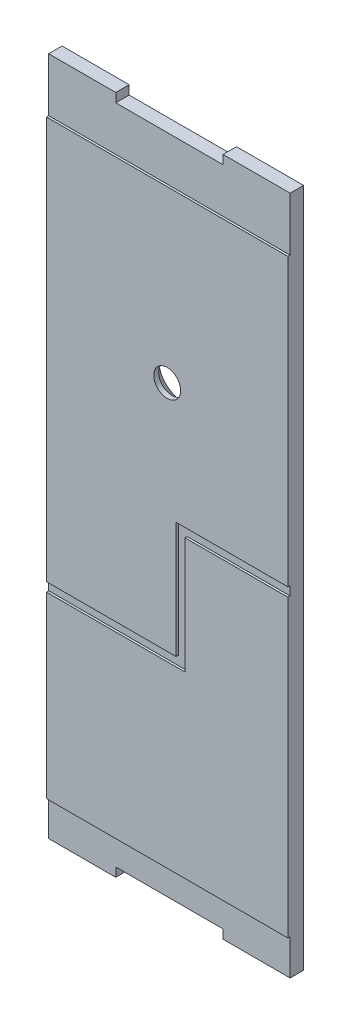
ISO-10303-21;
HEADER;
FILE_DESCRIPTION(('STEP AP214'),'2;1');
FILE_NAME('part.step','',(''),(''),'','','');
FILE_SCHEMA(('AUTOMOTIVE_DESIGN { 1 0 10303 214 1 1 1 1 }'));
ENDSEC;
DATA;
#1=APPLICATION_CONTEXT('core data for automotive mechanical design processes');
#2=APPLICATION_PROTOCOL_DEFINITION('international standard','automotive_design',2000,#1);
#3=PRODUCT_CONTEXT('',#1,'mechanical');
#4=PRODUCT('Part','Part','',(#3));
#5=PRODUCT_RELATED_PRODUCT_CATEGORY('part','',(#4));
#6=PRODUCT_DEFINITION_FORMATION('','',#4);
#7=PRODUCT_DEFINITION_CONTEXT('part definition',#1,'design');
#8=PRODUCT_DEFINITION('design','',#6,#7);
#9=PRODUCT_DEFINITION_SHAPE('','',#8);
#10=(LENGTH_UNIT() NAMED_UNIT(*) SI_UNIT(.MILLI.,.METRE.));
#11=(NAMED_UNIT(*) PLANE_ANGLE_UNIT() SI_UNIT($,.RADIAN.));
#12=(NAMED_UNIT(*) SI_UNIT($,.STERADIAN.) SOLID_ANGLE_UNIT());
#13=UNCERTAINTY_MEASURE_WITH_UNIT(LENGTH_MEASURE(1.E-05),#10,'distance_accuracy_value','');
#14=(GEOMETRIC_REPRESENTATION_CONTEXT(3) GLOBAL_UNCERTAINTY_ASSIGNED_CONTEXT((#13)) GLOBAL_UNIT_ASSIGNED_CONTEXT((#10,
#11,#12)) REPRESENTATION_CONTEXT('',''));
#15=CARTESIAN_POINT('',(0.,0.,0.));
#16=DIRECTION('',(0.,0.,1.));
#17=DIRECTION('',(1.,0.,0.));
#18=AXIS2_PLACEMENT_3D('',#15,#16,#17);
#19=CARTESIAN_POINT('',(0.,0.,1.5));
#20=DIRECTION('',(0.,1.,0.));
#21=DIRECTION('',(0.,0.,1.));
#22=AXIS2_PLACEMENT_3D('',#19,#20,#21);
#23=PLANE('',#22);
#24=DIRECTION('',(1.,0.,0.));
#25=VECTOR('',#24,1.);
#26=CARTESIAN_POINT('',(0.,0.,0.));
#27=LINE('',#26,#25);
#28=CARTESIAN_POINT('',(0.,0.,0.));
#29=VERTEX_POINT('',#28);
#30=CARTESIAN_POINT('',(7.50000000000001,0.,0.));
#31=VERTEX_POINT('',#30);
#32=EDGE_CURVE('E214',#29,#31,#27,.T.);
#33=ORIENTED_EDGE('',*,*,#32,.T.);
#34=DIRECTION('',(0.,0.,1.));
#35=VECTOR('',#34,1.);
#36=CARTESIAN_POINT('',(7.50000000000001,0.,0.));
#37=LINE('',#36,#35);
#38=CARTESIAN_POINT('',(7.50000000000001,0.,1.5));
#39=VERTEX_POINT('',#38);
#40=EDGE_CURVE('E197',#31,#39,#37,.T.);
#41=ORIENTED_EDGE('',*,*,#40,.T.);
#42=DIRECTION('',(1.,0.,0.));
#43=VECTOR('',#42,1.);
#44=CARTESIAN_POINT('',(0.,0.,1.5));
#45=LINE('',#44,#43);
#46=CARTESIAN_POINT('',(0.,0.,1.5));
#47=VERTEX_POINT('',#46);
#48=EDGE_CURVE('E285',#47,#39,#45,.T.);
#49=ORIENTED_EDGE('',*,*,#48,.F.);
#50=DIRECTION('',(0.,0.,-1.));
#51=VECTOR('',#50,1.);
#52=CARTESIAN_POINT('',(0.,0.,1.5));
#53=LINE('',#52,#51);
#54=EDGE_CURVE('E222',#47,#29,#53,.T.);
#55=ORIENTED_EDGE('',*,*,#54,.T.);
#56=EDGE_LOOP('',(#33,#41,#49,#55));
#57=FACE_BOUND('',#56,.T.);
#58=ADVANCED_FACE('F35',(#57),#23,.F.);
#59=CARTESIAN_POINT('',(0.,76.,1.5));
#60=DIRECTION('',(0.,-1.,0.));
#61=DIRECTION('',(0.,0.,-1.));
#62=AXIS2_PLACEMENT_3D('',#59,#60,#61);
#63=PLANE('',#62);
#64=DIRECTION('',(-1.,0.,0.));
#65=VECTOR('',#64,1.);
#66=CARTESIAN_POINT('',(0.,76.,1.5));
#67=LINE('',#66,#65);
#68=CARTESIAN_POINT('',(7.49999999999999,76.,1.5));
#69=VERTEX_POINT('',#68);
#70=CARTESIAN_POINT('',(0.,76.,1.5));
#71=VERTEX_POINT('',#70);
#72=EDGE_CURVE('E314',#69,#71,#67,.T.);
#73=ORIENTED_EDGE('',*,*,#72,.F.);
#74=DIRECTION('',(0.,0.,1.));
#75=VECTOR('',#74,1.);
#76=CARTESIAN_POINT('',(7.49999999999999,76.,0.));
#77=LINE('',#76,#75);
#78=CARTESIAN_POINT('',(7.49999999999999,76.,0.));
#79=VERTEX_POINT('',#78);
#80=EDGE_CURVE('E364',#79,#69,#77,.T.);
#81=ORIENTED_EDGE('',*,*,#80,.F.);
#82=DIRECTION('',(-1.,0.,0.));
#83=VECTOR('',#82,1.);
#84=CARTESIAN_POINT('',(0.,76.,0.));
#85=LINE('',#84,#83);
#86=CARTESIAN_POINT('',(0.,76.,0.));
#87=VERTEX_POINT('',#86);
#88=EDGE_CURVE('E227',#79,#87,#85,.T.);
#89=ORIENTED_EDGE('',*,*,#88,.T.);
#90=DIRECTION('',(0.,0.,-1.));
#91=VECTOR('',#90,1.);
#92=CARTESIAN_POINT('',(0.,76.,1.5));
#93=LINE('',#92,#91);
#94=EDGE_CURVE('E236',#71,#87,#93,.T.);
#95=ORIENTED_EDGE('',*,*,#94,.F.);
#96=EDGE_LOOP('',(#73,#81,#89,#95));
#97=FACE_BOUND('',#96,.T.);
#98=ADVANCED_FACE('F258',(#97),#63,.F.);
#99=CARTESIAN_POINT('',(0.,0.,1.75));
#100=DIRECTION('',(0.,0.,1.));
#101=DIRECTION('',(1.,0.,0.));
#102=AXIS2_PLACEMENT_3D('',#99,#100,#101);
#103=PLANE('',#102);
#104=DIRECTION('',(1.,0.,0.));
#105=VECTOR('',#104,1.);
#106=CARTESIAN_POINT('',(15.5,37.,1.75));
#107=LINE('',#106,#105);
#108=CARTESIAN_POINT('',(15.5,37.,1.75));
#109=VERTEX_POINT('',#108);
#110=CARTESIAN_POINT('',(27.,37.,1.75));
#111=VERTEX_POINT('',#110);
#112=EDGE_CURVE('E367',#109,#111,#107,.T.);
#113=ORIENTED_EDGE('',*,*,#112,.F.);
#114=DIRECTION('',(0.,1.,0.));
#115=VECTOR('',#114,1.);
#116=CARTESIAN_POINT('',(15.5,37.,1.75));
#117=LINE('',#116,#115);
#118=CARTESIAN_POINT('',(15.5,24.,1.75));
#119=VERTEX_POINT('',#118);
#120=EDGE_CURVE('E379',#119,#109,#117,.T.);
#121=ORIENTED_EDGE('',*,*,#120,.F.);
#122=DIRECTION('',(1.,0.,0.));
#123=VECTOR('',#122,1.);
#124=CARTESIAN_POINT('',(15.5,24.,1.75));
#125=LINE('',#124,#123);
#126=CARTESIAN_POINT('',(0.,24.,1.75));
#127=VERTEX_POINT('',#126);
#128=EDGE_CURVE('E407',#127,#119,#125,.T.);
#129=ORIENTED_EDGE('',*,*,#128,.F.);
#130=DIRECTION('',(0.,-1.,0.));
#131=VECTOR('',#130,1.);
#132=CARTESIAN_POINT('',(0.,76.,1.75));
#133=LINE('',#132,#131);
#134=CARTESIAN_POINT('',(0.,4.,1.75));
#135=VERTEX_POINT('',#134);
#136=EDGE_CURVE('E324',#127,#135,#133,.T.);
#137=ORIENTED_EDGE('',*,*,#136,.T.);
#138=DIRECTION('',(-1.,0.,0.));
#139=VECTOR('',#138,1.);
#140=CARTESIAN_POINT('',(0.,4.,1.75));
#141=LINE('',#140,#139);
#142=CARTESIAN_POINT('',(27.,4.,1.75));
#143=VERTEX_POINT('',#142);
#144=EDGE_CURVE('E289',#143,#135,#141,.T.);
#145=ORIENTED_EDGE('',*,*,#144,.F.);
#146=DIRECTION('',(0.,1.,0.));
#147=VECTOR('',#146,1.);
#148=CARTESIAN_POINT('',(27.,0.,1.75));
#149=LINE('',#148,#147);
#150=EDGE_CURVE('E329',#143,#111,#149,.T.);
#151=ORIENTED_EDGE('',*,*,#150,.T.);
#152=EDGE_LOOP('',(#113,#121,#129,#137,#145,#151));
#153=FACE_BOUND('',#152,.T.);
#154=ADVANCED_FACE('F264',(#153),#103,.T.);
#155=CARTESIAN_POINT('',(27.,76.,0.));
#156=VERTEX_POINT('',#155);
#157=CARTESIAN_POINT('',(19.5,76.,0.));
#158=VERTEX_POINT('',#157);
#159=EDGE_CURVE('E233',#156,#158,#85,.T.);
#160=ORIENTED_EDGE('',*,*,#159,.T.);
#161=DIRECTION('',(0.,0.,1.));
#162=VECTOR('',#161,1.);
#163=CARTESIAN_POINT('',(19.5,76.,0.));
#164=LINE('',#163,#162);
#165=CARTESIAN_POINT('',(19.5,76.,1.5));
#166=VERTEX_POINT('',#165);
#167=EDGE_CURVE('E359',#158,#166,#164,.T.);
#168=ORIENTED_EDGE('',*,*,#167,.T.);
#169=CARTESIAN_POINT('',(27.,76.,1.5));
#170=VERTEX_POINT('',#169);
#171=EDGE_CURVE('E315',#170,#166,#67,.T.);
#172=ORIENTED_EDGE('',*,*,#171,.F.);
#173=DIRECTION('',(0.,0.,-1.));
#174=VECTOR('',#173,1.);
#175=CARTESIAN_POINT('',(27.,76.,1.5));
#176=LINE('',#175,#174);
#177=EDGE_CURVE('E239',#170,#156,#176,.T.);
#178=ORIENTED_EDGE('',*,*,#177,.T.);
#179=EDGE_LOOP('',(#160,#168,#172,#178));
#180=FACE_BOUND('',#179,.T.);
#181=ADVANCED_FACE('F267',(#180),#63,.F.);
#182=CARTESIAN_POINT('',(0.,0.,1.5));
#183=DIRECTION('',(1.,0.,0.));
#184=DIRECTION('',(0.,0.,-1.));
#185=AXIS2_PLACEMENT_3D('',#182,#183,#184);
#186=PLANE('',#185);
#187=ORIENTED_EDGE('',*,*,#136,.F.);
#188=DIRECTION('',(0.,0.,1.));
#189=VECTOR('',#188,1.);
#190=CARTESIAN_POINT('',(0.,24.,1.5));
#191=LINE('',#190,#189);
#192=CARTESIAN_POINT('',(0.,24.,1.5));
#193=VERTEX_POINT('',#192);
#194=EDGE_CURVE('E416',#193,#127,#191,.T.);
#195=ORIENTED_EDGE('',*,*,#194,.F.);
#196=DIRECTION('',(0.,-1.,0.));
#197=VECTOR('',#196,1.);
#198=CARTESIAN_POINT('',(0.,25.,1.5));
#199=LINE('',#198,#197);
#200=CARTESIAN_POINT('',(0.,25.,1.5));
#201=VERTEX_POINT('',#200);
#202=EDGE_CURVE('E390',#201,#193,#199,.T.);
#203=ORIENTED_EDGE('',*,*,#202,.F.);
#204=DIRECTION('',(0.,0.,1.));
#205=VECTOR('',#204,1.);
#206=CARTESIAN_POINT('',(0.,25.,1.5));
#207=LINE('',#206,#205);
#208=CARTESIAN_POINT('',(0.,25.,1.75));
#209=VERTEX_POINT('',#208);
#210=EDGE_CURVE('E418',#201,#209,#207,.T.);
#211=ORIENTED_EDGE('',*,*,#210,.T.);
#212=CARTESIAN_POINT('',(0.,70.,1.75));
#213=VERTEX_POINT('',#212);
#214=EDGE_CURVE('E326',#213,#209,#133,.T.);
#215=ORIENTED_EDGE('',*,*,#214,.F.);
#216=DIRECTION('',(0.,0.,1.));
#217=VECTOR('',#216,1.);
#218=CARTESIAN_POINT('',(0.,70.,1.5));
#219=LINE('',#218,#217);
#220=CARTESIAN_POINT('',(0.,70.,1.5));
#221=VERTEX_POINT('',#220);
#222=EDGE_CURVE('E318',#221,#213,#219,.T.);
#223=ORIENTED_EDGE('',*,*,#222,.F.);
#224=DIRECTION('',(0.,-1.,0.));
#225=VECTOR('',#224,1.);
#226=CARTESIAN_POINT('',(0.,76.,1.5));
#227=LINE('',#226,#225);
#228=EDGE_CURVE('E306',#71,#221,#227,.T.);
#229=ORIENTED_EDGE('',*,*,#228,.F.);
#230=ORIENTED_EDGE('',*,*,#94,.T.);
#231=DIRECTION('',(0.,-1.,0.));
#232=VECTOR('',#231,1.);
#233=CARTESIAN_POINT('',(0.,0.,0.));
#234=LINE('',#233,#232);
#235=EDGE_CURVE('E229',#87,#29,#234,.T.);
#236=ORIENTED_EDGE('',*,*,#235,.T.);
#237=ORIENTED_EDGE('',*,*,#54,.F.);
#238=DIRECTION('',(0.,-1.,0.));
#239=VECTOR('',#238,1.);
#240=CARTESIAN_POINT('',(0.,0.,1.5));
#241=LINE('',#240,#239);
#242=CARTESIAN_POINT('',(0.,4.,1.5));
#243=VERTEX_POINT('',#242);
#244=EDGE_CURVE('E286',#243,#47,#241,.T.);
#245=ORIENTED_EDGE('',*,*,#244,.F.);
#246=DIRECTION('',(0.,0.,1.));
#247=VECTOR('',#246,1.);
#248=CARTESIAN_POINT('',(0.,4.,1.5));
#249=LINE('',#248,#247);
#250=EDGE_CURVE('E301',#243,#135,#249,.T.);
#251=ORIENTED_EDGE('',*,*,#250,.T.);
#252=EDGE_LOOP('',(#187,#195,#203,#211,#215,#223,#229,#230,#236,#237,#245,#251));
#253=FACE_BOUND('',#252,.T.);
#254=ADVANCED_FACE('F271',(#253),#186,.F.);
#255=CARTESIAN_POINT('',(19.5,0.,1.5));
#256=VERTEX_POINT('',#255);
#257=CARTESIAN_POINT('',(27.,0.,1.5));
#258=VERTEX_POINT('',#257);
#259=EDGE_CURVE('E281',#256,#258,#45,.T.);
#260=ORIENTED_EDGE('',*,*,#259,.F.);
#261=DIRECTION('',(0.,0.,1.));
#262=VECTOR('',#261,1.);
#263=CARTESIAN_POINT('',(19.5,0.,0.));
#264=LINE('',#263,#262);
#265=CARTESIAN_POINT('',(19.5,0.,0.));
#266=VERTEX_POINT('',#265);
#267=EDGE_CURVE('E50',#266,#256,#264,.T.);
#268=ORIENTED_EDGE('',*,*,#267,.F.);
#269=CARTESIAN_POINT('',(27.,0.,0.));
#270=VERTEX_POINT('',#269);
#271=EDGE_CURVE('E224',#266,#270,#27,.T.);
#272=ORIENTED_EDGE('',*,*,#271,.T.);
#273=DIRECTION('',(0.,0.,-1.));
#274=VECTOR('',#273,1.);
#275=CARTESIAN_POINT('',(27.,0.,1.5));
#276=LINE('',#275,#274);
#277=EDGE_CURVE('E241',#258,#270,#276,.T.);
#278=ORIENTED_EDGE('',*,*,#277,.F.);
#279=EDGE_LOOP('',(#260,#268,#272,#278));
#280=FACE_BOUND('',#279,.T.);
#281=ADVANCED_FACE('F260',(#280),#23,.F.);
#282=CARTESIAN_POINT('',(27.,0.,1.5));
#283=DIRECTION('',(-1.,0.,0.));
#284=DIRECTION('',(0.,0.,1.));
#285=AXIS2_PLACEMENT_3D('',#282,#283,#284);
#286=PLANE('',#285);
#287=DIRECTION('',(0.,1.,0.));
#288=VECTOR('',#287,1.);
#289=CARTESIAN_POINT('',(27.,38.,1.5));
#290=LINE('',#289,#288);
#291=CARTESIAN_POINT('',(27.,37.,1.5));
#292=VERTEX_POINT('',#291);
#293=CARTESIAN_POINT('',(27.,38.,1.5));
#294=VERTEX_POINT('',#293);
#295=EDGE_CURVE('E378',#292,#294,#290,.T.);
#296=ORIENTED_EDGE('',*,*,#295,.F.);
#297=DIRECTION('',(0.,0.,1.));
#298=VECTOR('',#297,1.);
#299=CARTESIAN_POINT('',(27.,37.,1.5));
#300=LINE('',#299,#298);
#301=EDGE_CURVE('E399',#292,#111,#300,.T.);
#302=ORIENTED_EDGE('',*,*,#301,.T.);
#303=ORIENTED_EDGE('',*,*,#150,.F.);
#304=DIRECTION('',(0.,0.,1.));
#305=VECTOR('',#304,1.);
#306=CARTESIAN_POINT('',(27.,4.,1.5));
#307=LINE('',#306,#305);
#308=CARTESIAN_POINT('',(27.,4.,1.5));
#309=VERTEX_POINT('',#308);
#310=EDGE_CURVE('E297',#309,#143,#307,.T.);
#311=ORIENTED_EDGE('',*,*,#310,.F.);
#312=DIRECTION('',(0.,1.,0.));
#313=VECTOR('',#312,1.);
#314=CARTESIAN_POINT('',(27.,0.,1.5));
#315=LINE('',#314,#313);
#316=EDGE_CURVE('E288',#258,#309,#315,.T.);
#317=ORIENTED_EDGE('',*,*,#316,.F.);
#318=ORIENTED_EDGE('',*,*,#277,.T.);
#319=DIRECTION('',(0.,1.,0.));
#320=VECTOR('',#319,1.);
#321=CARTESIAN_POINT('',(27.,0.,0.));
#322=LINE('',#321,#320);
#323=EDGE_CURVE('E223',#270,#156,#322,.T.);
#324=ORIENTED_EDGE('',*,*,#323,.T.);
#325=ORIENTED_EDGE('',*,*,#177,.F.);
#326=DIRECTION('',(0.,1.,0.));
#327=VECTOR('',#326,1.);
#328=CARTESIAN_POINT('',(27.,76.,1.5));
#329=LINE('',#328,#327);
#330=CARTESIAN_POINT('',(27.,70.,1.5));
#331=VERTEX_POINT('',#330);
#332=EDGE_CURVE('E312',#331,#170,#329,.T.);
#333=ORIENTED_EDGE('',*,*,#332,.F.);
#334=DIRECTION('',(0.,0.,1.));
#335=VECTOR('',#334,1.);
#336=CARTESIAN_POINT('',(27.,70.,1.5));
#337=LINE('',#336,#335);
#338=CARTESIAN_POINT('',(27.,70.,1.75));
#339=VERTEX_POINT('',#338);
#340=EDGE_CURVE('E321',#331,#339,#337,.T.);
#341=ORIENTED_EDGE('',*,*,#340,.T.);
#342=CARTESIAN_POINT('',(27.,38.,1.75));
#343=VERTEX_POINT('',#342);
#344=EDGE_CURVE('E328',#343,#339,#149,.T.);
#345=ORIENTED_EDGE('',*,*,#344,.F.);
#346=DIRECTION('',(0.,0.,1.));
#347=VECTOR('',#346,1.);
#348=CARTESIAN_POINT('',(27.,38.,1.5));
#349=LINE('',#348,#347);
#350=EDGE_CURVE('E425',#294,#343,#349,.T.);
#351=ORIENTED_EDGE('',*,*,#350,.F.);
#352=EDGE_LOOP('',(#296,#302,#303,#311,#317,#318,#324,#325,#333,#341,#345,#351));
#353=FACE_BOUND('',#352,.T.);
#354=ADVANCED_FACE('F270',(#353),#286,.F.);
#355=CARTESIAN_POINT('',(0.,0.,0.));
#356=DIRECTION('',(0.,0.,-1.));
#357=DIRECTION('',(-1.,0.,0.));
#358=AXIS2_PLACEMENT_3D('',#355,#356,#357);
#359=PLANE('',#358);
#360=CARTESIAN_POINT('',(13.5,51.,0.));
#361=DIRECTION('',(0.,0.,-1.));
#362=DIRECTION('',(-1.,0.,0.));
#363=AXIS2_PLACEMENT_3D('',#360,#361,#362);
#364=CIRCLE('',#363,2.69999999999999);
#365=CARTESIAN_POINT('',(10.8,51.,0.));
#366=VERTEX_POINT('',#365);
#367=EDGE_CURVE('E43',#366,#366,#364,.F.);
#368=ORIENTED_EDGE('',*,*,#367,.T.);
#369=EDGE_LOOP('',(#368));
#370=FACE_BOUND('',#369,.T.);
#371=DIRECTION('',(0.,-1.,0.));
#372=VECTOR('',#371,1.);
#373=CARTESIAN_POINT('',(7.50000000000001,0.,0.));
#374=LINE('',#373,#372);
#375=CARTESIAN_POINT('',(7.50000000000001,1.,0.));
#376=VERTEX_POINT('',#375);
#377=EDGE_CURVE('E200',#376,#31,#374,.T.);
#378=ORIENTED_EDGE('',*,*,#377,.T.);
#379=ORIENTED_EDGE('',*,*,#32,.F.);
#380=ORIENTED_EDGE('',*,*,#235,.F.);
#381=ORIENTED_EDGE('',*,*,#88,.F.);
#382=DIRECTION('',(0.,-1.,0.));
#383=VECTOR('',#382,1.);
#384=CARTESIAN_POINT('',(7.49999999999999,76.,0.));
#385=LINE('',#384,#383);
#386=CARTESIAN_POINT('',(7.49999999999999,75.,0.));
#387=VERTEX_POINT('',#386);
#388=EDGE_CURVE('E471',#79,#387,#385,.T.);
#389=ORIENTED_EDGE('',*,*,#388,.T.);
#390=DIRECTION('',(1.,0.,0.));
#391=VECTOR('',#390,1.);
#392=CARTESIAN_POINT('',(7.49999999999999,75.,0.));
#393=LINE('',#392,#391);
#394=CARTESIAN_POINT('',(19.5,75.,0.));
#395=VERTEX_POINT('',#394);
#396=EDGE_CURVE('E469',#387,#395,#393,.T.);
#397=ORIENTED_EDGE('',*,*,#396,.T.);
#398=DIRECTION('',(0.,1.,0.));
#399=VECTOR('',#398,1.);
#400=CARTESIAN_POINT('',(19.5,76.,0.));
#401=LINE('',#400,#399);
#402=EDGE_CURVE('E374',#395,#158,#401,.T.);
#403=ORIENTED_EDGE('',*,*,#402,.T.);
#404=ORIENTED_EDGE('',*,*,#159,.F.);
#405=ORIENTED_EDGE('',*,*,#323,.F.);
#406=ORIENTED_EDGE('',*,*,#271,.F.);
#407=DIRECTION('',(0.,1.,0.));
#408=VECTOR('',#407,1.);
#409=CARTESIAN_POINT('',(19.5,0.,0.));
#410=LINE('',#409,#408);
#411=CARTESIAN_POINT('',(19.5,1.,0.));
#412=VERTEX_POINT('',#411);
#413=EDGE_CURVE('E218',#266,#412,#410,.T.);
#414=ORIENTED_EDGE('',*,*,#413,.T.);
#415=DIRECTION('',(-1.,0.,0.));
#416=VECTOR('',#415,1.);
#417=CARTESIAN_POINT('',(7.50000000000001,1.,0.));
#418=LINE('',#417,#416);
#419=EDGE_CURVE('E208',#412,#376,#418,.T.);
#420=ORIENTED_EDGE('',*,*,#419,.T.);
#421=EDGE_LOOP('',(#378,#379,#380,#381,#389,#397,#403,#404,#405,#406,#414,#420));
#422=FACE_BOUND('',#421,.T.);
#423=ADVANCED_FACE('F212',(#370,#422),#359,.T.);
#424=DIRECTION('',(-1.,0.,0.));
#425=VECTOR('',#424,1.);
#426=CARTESIAN_POINT('',(0.,25.,1.75));
#427=LINE('',#426,#425);
#428=CARTESIAN_POINT('',(14.5,25.,1.75));
#429=VERTEX_POINT('',#428);
#430=EDGE_CURVE('E405',#429,#209,#427,.T.);
#431=ORIENTED_EDGE('',*,*,#430,.F.);
#432=DIRECTION('',(0.,-1.,0.));
#433=VECTOR('',#432,1.);
#434=CARTESIAN_POINT('',(14.5,38.,1.75));
#435=LINE('',#434,#433);
#436=CARTESIAN_POINT('',(14.5,38.,1.75));
#437=VERTEX_POINT('',#436);
#438=EDGE_CURVE('E402',#437,#429,#435,.T.);
#439=ORIENTED_EDGE('',*,*,#438,.F.);
#440=DIRECTION('',(-1.,0.,0.));
#441=VECTOR('',#440,1.);
#442=CARTESIAN_POINT('',(14.5,38.,1.75));
#443=LINE('',#442,#441);
#444=EDGE_CURVE('E345',#343,#437,#443,.T.);
#445=ORIENTED_EDGE('',*,*,#444,.F.);
#446=ORIENTED_EDGE('',*,*,#344,.T.);
#447=DIRECTION('',(1.,0.,0.));
#448=VECTOR('',#447,1.);
#449=CARTESIAN_POINT('',(0.,70.,1.75));
#450=LINE('',#449,#448);
#451=EDGE_CURVE('E304',#213,#339,#450,.T.);
#452=ORIENTED_EDGE('',*,*,#451,.F.);
#453=ORIENTED_EDGE('',*,*,#214,.T.);
#454=EDGE_LOOP('',(#431,#439,#445,#446,#452,#453));
#455=FACE_BOUND('',#454,.T.);
#456=CARTESIAN_POINT('',(13.5,51.,1.75));
#457=DIRECTION('',(0.,0.,1.));
#458=DIRECTION('',(1.,0.,0.));
#459=AXIS2_PLACEMENT_3D('',#456,#457,#458);
#460=CIRCLE('',#459,1.5);
#461=CARTESIAN_POINT('',(15.,51.,1.75));
#462=VERTEX_POINT('',#461);
#463=EDGE_CURVE('E300',#462,#462,#460,.T.);
#464=ORIENTED_EDGE('',*,*,#463,.F.);
#465=EDGE_LOOP('',(#464));
#466=FACE_BOUND('',#465,.T.);
#467=ADVANCED_FACE('F340',(#455,#466),#103,.T.);
#468=CARTESIAN_POINT('',(0.,70.,1.5));
#469=DIRECTION('',(0.,-1.,0.));
#470=DIRECTION('',(0.,0.,-1.));
#471=AXIS2_PLACEMENT_3D('',#468,#469,#470);
#472=PLANE('',#471);
#473=ORIENTED_EDGE('',*,*,#451,.T.);
#474=ORIENTED_EDGE('',*,*,#340,.F.);
#475=DIRECTION('',(1.,0.,0.));
#476=VECTOR('',#475,1.);
#477=CARTESIAN_POINT('',(0.,70.,1.5));
#478=LINE('',#477,#476);
#479=EDGE_CURVE('E309',#221,#331,#478,.T.);
#480=ORIENTED_EDGE('',*,*,#479,.F.);
#481=ORIENTED_EDGE('',*,*,#222,.T.);
#482=EDGE_LOOP('',(#473,#474,#480,#481));
#483=FACE_BOUND('',#482,.T.);
#484=ADVANCED_FACE('F348',(#483),#472,.F.);
#485=CARTESIAN_POINT('',(0.,0.,1.5));
#486=DIRECTION('',(0.,0.,1.));
#487=DIRECTION('',(1.,0.,0.));
#488=AXIS2_PLACEMENT_3D('',#485,#486,#487);
#489=PLANE('',#488);
#490=DIRECTION('',(0.,-1.,0.));
#491=VECTOR('',#490,1.);
#492=CARTESIAN_POINT('',(7.49999999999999,76.,1.5));
#493=LINE('',#492,#491);
#494=CARTESIAN_POINT('',(7.49999999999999,75.,1.5));
#495=VERTEX_POINT('',#494);
#496=EDGE_CURVE('E58',#69,#495,#493,.T.);
#497=ORIENTED_EDGE('',*,*,#496,.F.);
#498=ORIENTED_EDGE('',*,*,#72,.T.);
#499=ORIENTED_EDGE('',*,*,#228,.T.);
#500=ORIENTED_EDGE('',*,*,#479,.T.);
#501=ORIENTED_EDGE('',*,*,#332,.T.);
#502=ORIENTED_EDGE('',*,*,#171,.T.);
#503=DIRECTION('',(0.,1.,0.));
#504=VECTOR('',#503,1.);
#505=CARTESIAN_POINT('',(19.5,76.,1.5));
#506=LINE('',#505,#504);
#507=CARTESIAN_POINT('',(19.5,75.,1.5));
#508=VERTEX_POINT('',#507);
#509=EDGE_CURVE('E479',#508,#166,#506,.T.);
#510=ORIENTED_EDGE('',*,*,#509,.F.);
#511=DIRECTION('',(1.,0.,0.));
#512=VECTOR('',#511,1.);
#513=CARTESIAN_POINT('',(7.49999999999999,75.,1.5));
#514=LINE('',#513,#512);
#515=EDGE_CURVE('E476',#495,#508,#514,.T.);
#516=ORIENTED_EDGE('',*,*,#515,.F.);
#517=EDGE_LOOP('',(#497,#498,#499,#500,#501,#502,#510,#516));
#518=FACE_BOUND('',#517,.T.);
#519=ADVANCED_FACE('F355',(#518),#489,.T.);
#520=CARTESIAN_POINT('',(0.,4.,1.5));
#521=DIRECTION('',(0.,1.,0.));
#522=DIRECTION('',(0.,0.,1.));
#523=AXIS2_PLACEMENT_3D('',#520,#521,#522);
#524=PLANE('',#523);
#525=ORIENTED_EDGE('',*,*,#144,.T.);
#526=ORIENTED_EDGE('',*,*,#250,.F.);
#527=DIRECTION('',(-1.,0.,0.));
#528=VECTOR('',#527,1.);
#529=CARTESIAN_POINT('',(0.,4.,1.5));
#530=LINE('',#529,#528);
#531=EDGE_CURVE('E294',#309,#243,#530,.T.);
#532=ORIENTED_EDGE('',*,*,#531,.F.);
#533=ORIENTED_EDGE('',*,*,#310,.T.);
#534=EDGE_LOOP('',(#525,#526,#532,#533));
#535=FACE_BOUND('',#534,.T.);
#536=ADVANCED_FACE('F463',(#535),#524,.F.);
#537=CARTESIAN_POINT('',(0.,0.,1.5));
#538=DIRECTION('',(0.,0.,-1.));
#539=DIRECTION('',(-1.,0.,0.));
#540=AXIS2_PLACEMENT_3D('',#537,#538,#539);
#541=PLANE('',#540);
#542=ORIENTED_EDGE('',*,*,#48,.T.);
#543=DIRECTION('',(0.,-1.,0.));
#544=VECTOR('',#543,1.);
#545=CARTESIAN_POINT('',(7.50000000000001,0.,1.5));
#546=LINE('',#545,#544);
#547=CARTESIAN_POINT('',(7.50000000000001,1.,1.5));
#548=VERTEX_POINT('',#547);
#549=EDGE_CURVE('E203',#548,#39,#546,.T.);
#550=ORIENTED_EDGE('',*,*,#549,.F.);
#551=DIRECTION('',(-1.,0.,0.));
#552=VECTOR('',#551,1.);
#553=CARTESIAN_POINT('',(7.50000000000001,1.,1.5));
#554=LINE('',#553,#552);
#555=CARTESIAN_POINT('',(19.5,1.,1.5));
#556=VERTEX_POINT('',#555);
#557=EDGE_CURVE('E219',#556,#548,#554,.T.);
#558=ORIENTED_EDGE('',*,*,#557,.F.);
#559=DIRECTION('',(0.,1.,0.));
#560=VECTOR('',#559,1.);
#561=CARTESIAN_POINT('',(19.5,0.,1.5));
#562=LINE('',#561,#560);
#563=EDGE_CURVE('E488',#256,#556,#562,.T.);
#564=ORIENTED_EDGE('',*,*,#563,.F.);
#565=ORIENTED_EDGE('',*,*,#259,.T.);
#566=ORIENTED_EDGE('',*,*,#316,.T.);
#567=ORIENTED_EDGE('',*,*,#531,.T.);
#568=ORIENTED_EDGE('',*,*,#244,.T.);
#569=EDGE_LOOP('',(#542,#550,#558,#564,#565,#566,#567,#568));
#570=FACE_BOUND('',#569,.T.);
#571=ADVANCED_FACE('F464',(#570),#541,.F.);
#572=CARTESIAN_POINT('',(13.5,51.,0.));
#573=DIRECTION('',(0.,0.,1.));
#574=DIRECTION('',(1.,0.,0.));
#575=AXIS2_PLACEMENT_3D('',#572,#573,#574);
#576=CYLINDRICAL_SURFACE('',#575,1.5);
#577=CARTESIAN_POINT('',(13.5,51.,1.2));
#578=DIRECTION('',(0.,0.,-1.));
#579=DIRECTION('',(-1.,0.,0.));
#580=AXIS2_PLACEMENT_3D('',#577,#578,#579);
#581=CIRCLE('',#580,1.5);
#582=CARTESIAN_POINT('',(12.,51.,1.2));
#583=VERTEX_POINT('',#582);
#584=EDGE_CURVE('E11',#583,#583,#581,.T.);
#585=ORIENTED_EDGE('',*,*,#584,.T.);
#586=EDGE_LOOP('',(#585));
#587=FACE_BOUND('',#586,.T.);
#588=ORIENTED_EDGE('',*,*,#463,.T.);
#589=EDGE_LOOP('',(#588));
#590=FACE_BOUND('',#589,.T.);
#591=ADVANCED_FACE('F431',(#587,#590),#576,.F.);
#592=CARTESIAN_POINT('',(15.5,37.,1.5));
#593=DIRECTION('',(0.,-1.,0.));
#594=DIRECTION('',(0.,0.,-1.));
#595=AXIS2_PLACEMENT_3D('',#592,#593,#594);
#596=PLANE('',#595);
#597=ORIENTED_EDGE('',*,*,#112,.T.);
#598=ORIENTED_EDGE('',*,*,#301,.F.);
#599=DIRECTION('',(1.,0.,0.));
#600=VECTOR('',#599,1.);
#601=CARTESIAN_POINT('',(15.5,37.,1.5));
#602=LINE('',#601,#600);
#603=CARTESIAN_POINT('',(15.5,37.,1.5));
#604=VERTEX_POINT('',#603);
#605=EDGE_CURVE('E375',#604,#292,#602,.T.);
#606=ORIENTED_EDGE('',*,*,#605,.F.);
#607=DIRECTION('',(0.,0.,1.));
#608=VECTOR('',#607,1.);
#609=CARTESIAN_POINT('',(15.5,37.,1.5));
#610=LINE('',#609,#608);
#611=EDGE_CURVE('E412',#604,#109,#610,.T.);
#612=ORIENTED_EDGE('',*,*,#611,.T.);
#613=EDGE_LOOP('',(#597,#598,#606,#612));
#614=FACE_BOUND('',#613,.T.);
#615=ADVANCED_FACE('F447',(#614),#596,.F.);
#616=CARTESIAN_POINT('',(15.5,37.,1.5));
#617=DIRECTION('',(1.,0.,0.));
#618=DIRECTION('',(0.,1.,0.));
#619=AXIS2_PLACEMENT_3D('',#616,#617,#618);
#620=PLANE('',#619);
#621=ORIENTED_EDGE('',*,*,#120,.T.);
#622=ORIENTED_EDGE('',*,*,#611,.F.);
#623=DIRECTION('',(0.,1.,0.));
#624=VECTOR('',#623,1.);
#625=CARTESIAN_POINT('',(15.5,37.,1.5));
#626=LINE('',#625,#624);
#627=CARTESIAN_POINT('',(15.5,24.,1.5));
#628=VERTEX_POINT('',#627);
#629=EDGE_CURVE('E396',#628,#604,#626,.T.);
#630=ORIENTED_EDGE('',*,*,#629,.F.);
#631=DIRECTION('',(0.,0.,1.));
#632=VECTOR('',#631,1.);
#633=CARTESIAN_POINT('',(15.5,24.,1.5));
#634=LINE('',#633,#632);
#635=EDGE_CURVE('E414',#628,#119,#634,.T.);
#636=ORIENTED_EDGE('',*,*,#635,.T.);
#637=EDGE_LOOP('',(#621,#622,#630,#636));
#638=FACE_BOUND('',#637,.T.);
#639=ADVANCED_FACE('F454',(#638),#620,.F.);
#640=CARTESIAN_POINT('',(15.5,24.,1.5));
#641=DIRECTION('',(0.,-1.,0.));
#642=DIRECTION('',(1.,0.,0.));
#643=AXIS2_PLACEMENT_3D('',#640,#641,#642);
#644=PLANE('',#643);
#645=ORIENTED_EDGE('',*,*,#128,.T.);
#646=ORIENTED_EDGE('',*,*,#635,.F.);
#647=DIRECTION('',(1.,0.,0.));
#648=VECTOR('',#647,1.);
#649=CARTESIAN_POINT('',(15.5,24.,1.5));
#650=LINE('',#649,#648);
#651=EDGE_CURVE('E393',#193,#628,#650,.T.);
#652=ORIENTED_EDGE('',*,*,#651,.F.);
#653=ORIENTED_EDGE('',*,*,#194,.T.);
#654=EDGE_LOOP('',(#645,#646,#652,#653));
#655=FACE_BOUND('',#654,.T.);
#656=ADVANCED_FACE('F456',(#655),#644,.F.);
#657=CARTESIAN_POINT('',(0.,25.,1.5));
#658=DIRECTION('',(0.,1.,0.));
#659=DIRECTION('',(-1.,0.,0.));
#660=AXIS2_PLACEMENT_3D('',#657,#658,#659);
#661=PLANE('',#660);
#662=ORIENTED_EDGE('',*,*,#430,.T.);
#663=ORIENTED_EDGE('',*,*,#210,.F.);
#664=DIRECTION('',(-1.,0.,0.));
#665=VECTOR('',#664,1.);
#666=CARTESIAN_POINT('',(12.5,25.,1.5));
#667=LINE('',#666,#665);
#668=CARTESIAN_POINT('',(14.5,25.,1.5));
#669=VERTEX_POINT('',#668);
#670=EDGE_CURVE('E388',#669,#201,#667,.T.);
#671=ORIENTED_EDGE('',*,*,#670,.F.);
#672=DIRECTION('',(0.,0.,1.));
#673=VECTOR('',#672,1.);
#674=CARTESIAN_POINT('',(14.5,25.,1.5));
#675=LINE('',#674,#673);
#676=EDGE_CURVE('E421',#669,#429,#675,.T.);
#677=ORIENTED_EDGE('',*,*,#676,.T.);
#678=EDGE_LOOP('',(#662,#663,#671,#677));
#679=FACE_BOUND('',#678,.T.);
#680=ADVANCED_FACE('F520',(#679),#661,.F.);
#681=CARTESIAN_POINT('',(14.5,38.,1.5));
#682=DIRECTION('',(-1.,0.,0.));
#683=DIRECTION('',(0.,-1.,0.));
#684=AXIS2_PLACEMENT_3D('',#681,#682,#683);
#685=PLANE('',#684);
#686=ORIENTED_EDGE('',*,*,#438,.T.);
#687=ORIENTED_EDGE('',*,*,#676,.F.);
#688=DIRECTION('',(0.,-1.,0.));
#689=VECTOR('',#688,1.);
#690=CARTESIAN_POINT('',(14.5,38.,1.5));
#691=LINE('',#690,#689);
#692=CARTESIAN_POINT('',(14.5,38.,1.5));
#693=VERTEX_POINT('',#692);
#694=EDGE_CURVE('E385',#693,#669,#691,.T.);
#695=ORIENTED_EDGE('',*,*,#694,.F.);
#696=DIRECTION('',(0.,0.,1.));
#697=VECTOR('',#696,1.);
#698=CARTESIAN_POINT('',(14.5,38.,1.5));
#699=LINE('',#698,#697);
#700=EDGE_CURVE('E423',#693,#437,#699,.T.);
#701=ORIENTED_EDGE('',*,*,#700,.T.);
#702=EDGE_LOOP('',(#686,#687,#695,#701));
#703=FACE_BOUND('',#702,.T.);
#704=ADVANCED_FACE('F523',(#703),#685,.F.);
#705=CARTESIAN_POINT('',(14.5,38.,1.5));
#706=DIRECTION('',(0.,1.,0.));
#707=DIRECTION('',(0.,0.,1.));
#708=AXIS2_PLACEMENT_3D('',#705,#706,#707);
#709=PLANE('',#708);
#710=ORIENTED_EDGE('',*,*,#444,.T.);
#711=ORIENTED_EDGE('',*,*,#700,.F.);
#712=DIRECTION('',(-1.,0.,0.));
#713=VECTOR('',#712,1.);
#714=CARTESIAN_POINT('',(14.5,38.,1.5));
#715=LINE('',#714,#713);
#716=EDGE_CURVE('E382',#294,#693,#715,.T.);
#717=ORIENTED_EDGE('',*,*,#716,.F.);
#718=ORIENTED_EDGE('',*,*,#350,.T.);
#719=EDGE_LOOP('',(#710,#711,#717,#718));
#720=FACE_BOUND('',#719,.T.);
#721=ADVANCED_FACE('F515',(#720),#709,.F.);
#722=CARTESIAN_POINT('',(0.,0.,1.5));
#723=DIRECTION('',(0.,0.,-1.));
#724=DIRECTION('',(-1.,0.,0.));
#725=AXIS2_PLACEMENT_3D('',#722,#723,#724);
#726=PLANE('',#725);
#727=ORIENTED_EDGE('',*,*,#605,.T.);
#728=ORIENTED_EDGE('',*,*,#295,.T.);
#729=ORIENTED_EDGE('',*,*,#716,.T.);
#730=ORIENTED_EDGE('',*,*,#694,.T.);
#731=ORIENTED_EDGE('',*,*,#670,.T.);
#732=ORIENTED_EDGE('',*,*,#202,.T.);
#733=ORIENTED_EDGE('',*,*,#651,.T.);
#734=ORIENTED_EDGE('',*,*,#629,.T.);
#735=EDGE_LOOP('',(#727,#728,#729,#730,#731,#732,#733,#734));
#736=FACE_BOUND('',#735,.T.);
#737=ADVANCED_FACE('F451',(#736),#726,.F.);
#738=CARTESIAN_POINT('',(7.49999999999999,76.,0.));
#739=DIRECTION('',(-1.,0.,0.));
#740=DIRECTION('',(0.,-1.,0.));
#741=AXIS2_PLACEMENT_3D('',#738,#739,#740);
#742=PLANE('',#741);
#743=ORIENTED_EDGE('',*,*,#496,.T.);
#744=DIRECTION('',(0.,0.,1.));
#745=VECTOR('',#744,1.);
#746=CARTESIAN_POINT('',(7.49999999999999,75.,0.));
#747=LINE('',#746,#745);
#748=EDGE_CURVE('E369',#387,#495,#747,.T.);
#749=ORIENTED_EDGE('',*,*,#748,.F.);
#750=ORIENTED_EDGE('',*,*,#388,.F.);
#751=ORIENTED_EDGE('',*,*,#80,.T.);
#752=EDGE_LOOP('',(#743,#749,#750,#751));
#753=FACE_BOUND('',#752,.T.);
#754=ADVANCED_FACE('F498',(#753),#742,.F.);
#755=CARTESIAN_POINT('',(19.5,76.,0.));
#756=DIRECTION('',(1.,0.,0.));
#757=DIRECTION('',(0.,1.,0.));
#758=AXIS2_PLACEMENT_3D('',#755,#756,#757);
#759=PLANE('',#758);
#760=ORIENTED_EDGE('',*,*,#509,.T.);
#761=ORIENTED_EDGE('',*,*,#167,.F.);
#762=ORIENTED_EDGE('',*,*,#402,.F.);
#763=DIRECTION('',(0.,0.,1.));
#764=VECTOR('',#763,1.);
#765=CARTESIAN_POINT('',(19.5,75.,0.));
#766=LINE('',#765,#764);
#767=EDGE_CURVE('E365',#395,#508,#766,.T.);
#768=ORIENTED_EDGE('',*,*,#767,.T.);
#769=EDGE_LOOP('',(#760,#761,#762,#768));
#770=FACE_BOUND('',#769,.T.);
#771=ADVANCED_FACE('F502',(#770),#759,.F.);
#772=CARTESIAN_POINT('',(7.49999999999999,75.,0.));
#773=DIRECTION('',(0.,-1.,0.));
#774=DIRECTION('',(0.,0.,-1.));
#775=AXIS2_PLACEMENT_3D('',#772,#773,#774);
#776=PLANE('',#775);
#777=ORIENTED_EDGE('',*,*,#515,.T.);
#778=ORIENTED_EDGE('',*,*,#767,.F.);
#779=ORIENTED_EDGE('',*,*,#396,.F.);
#780=ORIENTED_EDGE('',*,*,#748,.T.);
#781=EDGE_LOOP('',(#777,#778,#779,#780));
#782=FACE_BOUND('',#781,.T.);
#783=ADVANCED_FACE('F501',(#782),#776,.F.);
#784=CARTESIAN_POINT('',(7.50000000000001,0.,0.));
#785=DIRECTION('',(-1.,0.,0.));
#786=DIRECTION('',(0.,-1.,0.));
#787=AXIS2_PLACEMENT_3D('',#784,#785,#786);
#788=PLANE('',#787);
#789=ORIENTED_EDGE('',*,*,#549,.T.);
#790=ORIENTED_EDGE('',*,*,#40,.F.);
#791=ORIENTED_EDGE('',*,*,#377,.F.);
#792=DIRECTION('',(0.,0.,1.));
#793=VECTOR('',#792,1.);
#794=CARTESIAN_POINT('',(7.50000000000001,1.,0.));
#795=LINE('',#794,#793);
#796=EDGE_CURVE('E477',#376,#548,#795,.T.);
#797=ORIENTED_EDGE('',*,*,#796,.T.);
#798=EDGE_LOOP('',(#789,#790,#791,#797));
#799=FACE_BOUND('',#798,.T.);
#800=ADVANCED_FACE('F199',(#799),#788,.F.);
#801=CARTESIAN_POINT('',(7.50000000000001,1.,0.));
#802=DIRECTION('',(0.,1.,0.));
#803=DIRECTION('',(-1.,0.,0.));
#804=AXIS2_PLACEMENT_3D('',#801,#802,#803);
#805=PLANE('',#804);
#806=ORIENTED_EDGE('',*,*,#557,.T.);
#807=ORIENTED_EDGE('',*,*,#796,.F.);
#808=ORIENTED_EDGE('',*,*,#419,.F.);
#809=DIRECTION('',(0.,0.,1.));
#810=VECTOR('',#809,1.);
#811=CARTESIAN_POINT('',(19.5,1.,0.));
#812=LINE('',#811,#810);
#813=EDGE_CURVE('E483',#412,#556,#812,.T.);
#814=ORIENTED_EDGE('',*,*,#813,.T.);
#815=EDGE_LOOP('',(#806,#807,#808,#814));
#816=FACE_BOUND('',#815,.T.);
#817=ADVANCED_FACE('F254',(#816),#805,.F.);
#818=CARTESIAN_POINT('',(19.5,0.,0.));
#819=DIRECTION('',(1.,0.,0.));
#820=DIRECTION('',(0.,0.,-1.));
#821=AXIS2_PLACEMENT_3D('',#818,#819,#820);
#822=PLANE('',#821);
#823=ORIENTED_EDGE('',*,*,#563,.T.);
#824=ORIENTED_EDGE('',*,*,#813,.F.);
#825=ORIENTED_EDGE('',*,*,#413,.F.);
#826=ORIENTED_EDGE('',*,*,#267,.T.);
#827=EDGE_LOOP('',(#823,#824,#825,#826));
#828=FACE_BOUND('',#827,.T.);
#829=ADVANCED_FACE('F249',(#828),#822,.F.);
#830=CARTESIAN_POINT('',(13.5,51.,0.));
#831=DIRECTION('',(0.,0.,-1.));
#832=DIRECTION('',(-1.,0.,0.));
#833=AXIS2_PLACEMENT_3D('',#830,#831,#832);
#834=CONICAL_SURFACE('',#833,2.69999999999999,0.785398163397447);
#835=ORIENTED_EDGE('',*,*,#584,.F.);
#836=EDGE_LOOP('',(#835));
#837=FACE_BOUND('',#836,.T.);
#838=ORIENTED_EDGE('',*,*,#367,.F.);
#839=EDGE_LOOP('',(#838));
#840=FACE_BOUND('',#839,.T.);
#841=ADVANCED_FACE('F37',(#837,#840),#834,.F.);
#842=CLOSED_SHELL('',(#58,#98,#154,#181,#254,#281,#354,#423,#467,#484,#519,#536,#571,#591,#615,
#639,#656,#680,#704,#721,#737,#754,#771,#783,#800,#817,#829,#841));
#843=MANIFOLD_SOLID_BREP('B2',#842);
#844=ADVANCED_BREP_SHAPE_REPRESENTATION('',(#18,#843),#14);
#845=SHAPE_DEFINITION_REPRESENTATION(#9,#844);
ENDSEC;
END-ISO-10303-21;
